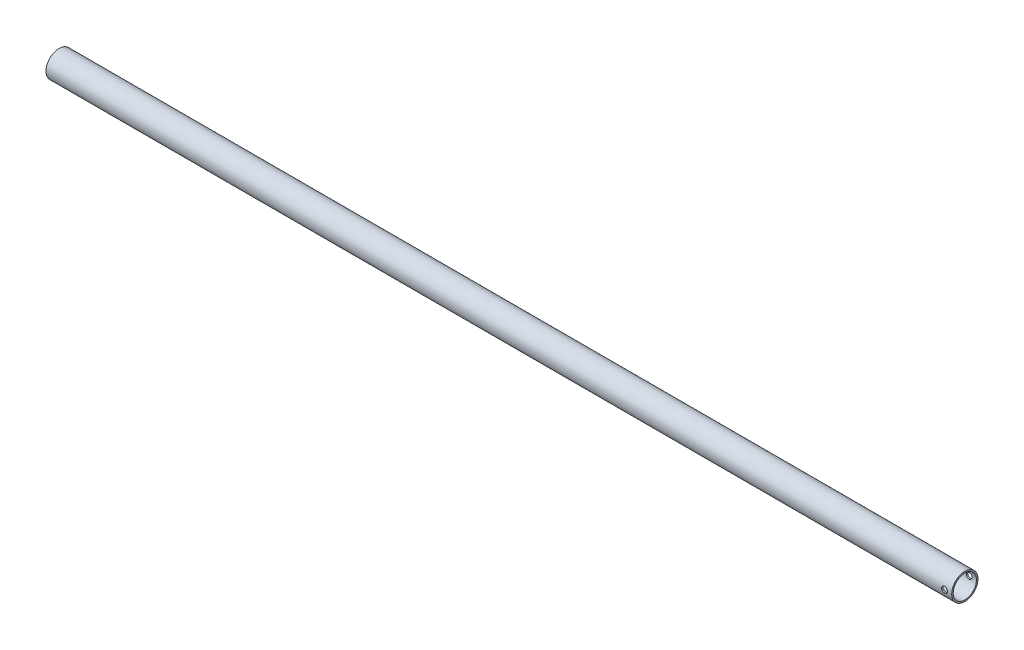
ISO-10303-21;
HEADER;
FILE_DESCRIPTION(('STEP AP214'),'2;1');
FILE_NAME('part.step','',(''),(''),'','','');
FILE_SCHEMA(('AUTOMOTIVE_DESIGN { 1 0 10303 214 1 1 1 1 }'));
ENDSEC;
DATA;
#1=APPLICATION_CONTEXT('core data for automotive mechanical design processes');
#2=APPLICATION_PROTOCOL_DEFINITION('international standard','automotive_design',2000,#1);
#3=PRODUCT_CONTEXT('',#1,'mechanical');
#4=PRODUCT('Part','Part','',(#3));
#5=PRODUCT_RELATED_PRODUCT_CATEGORY('part','',(#4));
#6=PRODUCT_DEFINITION_FORMATION('','',#4);
#7=PRODUCT_DEFINITION_CONTEXT('part definition',#1,'design');
#8=PRODUCT_DEFINITION('design','',#6,#7);
#9=PRODUCT_DEFINITION_SHAPE('','',#8);
#10=(LENGTH_UNIT() NAMED_UNIT(*) SI_UNIT(.MILLI.,.METRE.));
#11=(NAMED_UNIT(*) PLANE_ANGLE_UNIT() SI_UNIT($,.RADIAN.));
#12=(NAMED_UNIT(*) SI_UNIT($,.STERADIAN.) SOLID_ANGLE_UNIT());
#13=UNCERTAINTY_MEASURE_WITH_UNIT(LENGTH_MEASURE(1.E-05),#10,'distance_accuracy_value','');
#14=(GEOMETRIC_REPRESENTATION_CONTEXT(3) GLOBAL_UNCERTAINTY_ASSIGNED_CONTEXT((#13)) GLOBAL_UNIT_ASSIGNED_CONTEXT((#10,
#11,#12)) REPRESENTATION_CONTEXT('',''));
#15=CARTESIAN_POINT('',(0.,0.,0.));
#16=DIRECTION('',(0.,0.,1.));
#17=DIRECTION('',(1.,0.,0.));
#18=AXIS2_PLACEMENT_3D('',#15,#16,#17);
#19=CARTESIAN_POINT('',(0.,14.2875,0.));
#20=DIRECTION('',(1.,0.,0.));
#21=DIRECTION('',(0.,0.,-1.));
#22=AXIS2_PLACEMENT_3D('',#19,#20,#21);
#23=PLANE('',#22);
#24=CARTESIAN_POINT('',(0.,0.,0.));
#25=DIRECTION('',(1.,0.,0.));
#26=DIRECTION('',(0.,0.,-1.));
#27=AXIS2_PLACEMENT_3D('',#24,#25,#26);
#28=CIRCLE('',#27,14.2875);
#29=CARTESIAN_POINT('',(0.,0.,-14.2875));
#30=VERTEX_POINT('',#29);
#31=EDGE_CURVE('E94',#30,#30,#28,.T.);
#32=ORIENTED_EDGE('',*,*,#31,.T.);
#33=EDGE_LOOP('',(#32));
#34=FACE_BOUND('',#33,.T.);
#35=CARTESIAN_POINT('',(0.,0.,0.));
#36=DIRECTION('',(1.,0.,0.));
#37=DIRECTION('',(0.,0.,-1.));
#38=AXIS2_PLACEMENT_3D('',#35,#36,#37);
#39=CIRCLE('',#38,12.6365);
#40=CARTESIAN_POINT('',(0.,0.,-12.6365));
#41=VERTEX_POINT('',#40);
#42=EDGE_CURVE('E10',#41,#41,#39,.T.);
#43=ORIENTED_EDGE('',*,*,#42,.F.);
#44=EDGE_LOOP('',(#43));
#45=FACE_BOUND('',#44,.T.);
#46=ADVANCED_FACE('F30',(#34,#45),#23,.T.);
#47=CARTESIAN_POINT('',(0.,0.,0.));
#48=DIRECTION('',(1.,0.,0.));
#49=DIRECTION('',(0.,0.,-1.));
#50=AXIS2_PLACEMENT_3D('',#47,#48,#49);
#51=CYLINDRICAL_SURFACE('',#50,12.6364999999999);
#52=CARTESIAN_POINT('',(-11.0998,0.,-12.6364999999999));
#53=CARTESIAN_POINT('',(-11.0997951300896,-0.175392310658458,-12.6364970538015));
#54=CARTESIAN_POINT('',(-11.0852176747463,-0.350838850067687,-12.632812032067));
#55=CARTESIAN_POINT('',(-11.0273815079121,-0.696701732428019,-12.6184688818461));
#56=CARTESIAN_POINT('',(-10.9841067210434,-0.867115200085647,-12.607806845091));
#57=CARTESIAN_POINT('',(-10.8703534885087,-1.19786758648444,-12.580690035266));
#58=CARTESIAN_POINT('',(-10.7999078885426,-1.35821839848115,-12.5642422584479));
#59=CARTESIAN_POINT('',(-10.6339287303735,-1.6648266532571,-12.5273046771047));
#60=CARTESIAN_POINT('',(-10.5383942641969,-1.81108358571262,-12.5068147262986));
#61=CARTESIAN_POINT('',(-10.3228516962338,-2.08839269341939,-12.4635401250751));
#62=CARTESIAN_POINT('',(-10.2024201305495,-2.21911017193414,-12.4407197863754));
#63=CARTESIAN_POINT('',(-9.94140850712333,-2.45872056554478,-12.3955929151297));
#64=CARTESIAN_POINT('',(-9.80082615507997,-2.56761099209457,-12.3732864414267));
#65=CARTESIAN_POINT('',(-9.50089944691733,-2.76205463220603,-12.3313527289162));
#66=CARTESIAN_POINT('',(-9.34130494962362,-2.84723266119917,-12.3117707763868));
#67=CARTESIAN_POINT('',(-9.00949056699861,-2.98942057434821,-12.2780240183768));
#68=CARTESIAN_POINT('',(-8.83727272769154,-3.04643501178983,-12.2638583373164));
#69=CARTESIAN_POINT('',(-8.48878254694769,-3.12953400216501,-12.2429149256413));
#70=CARTESIAN_POINT('',(-8.31266262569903,-3.15622071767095,-12.2359935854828));
#71=CARTESIAN_POINT('',(-7.95832001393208,-3.17978249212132,-12.229892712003));
#72=CARTESIAN_POINT('',(-7.78009767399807,-3.17666245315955,-12.2307119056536));
#73=CARTESIAN_POINT('',(-7.43123059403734,-3.14117954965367,-12.2398704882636));
#74=CARTESIAN_POINT('',(-7.26050718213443,-3.10953504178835,-12.2480251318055));
#75=CARTESIAN_POINT('',(-6.92687351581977,-3.01904774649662,-12.2706412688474));
#76=CARTESIAN_POINT('',(-6.76396382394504,-2.96020300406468,-12.285103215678));
#77=CARTESIAN_POINT('',(-6.44865970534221,-2.81637541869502,-12.3188735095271));
#78=CARTESIAN_POINT('',(-6.29638924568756,-2.73113251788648,-12.3382297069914));
#79=CARTESIAN_POINT('',(-6.00805649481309,-2.53711019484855,-12.3795806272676));
#80=CARTESIAN_POINT('',(-5.87199707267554,-2.42832661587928,-12.4015758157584));
#81=CARTESIAN_POINT('',(-5.61583290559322,-2.18659342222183,-12.4465036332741));
#82=CARTESIAN_POINT('',(-5.49630081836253,-2.053037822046,-12.4694450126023));
#83=CARTESIAN_POINT('',(-5.28122089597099,-1.76750165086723,-12.5131090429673));
#84=CARTESIAN_POINT('',(-5.18567380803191,-1.61552050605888,-12.5338316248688));
#85=CARTESIAN_POINT('',(-5.02106277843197,-1.29662523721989,-12.5708280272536));
#86=CARTESIAN_POINT('',(-4.95209263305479,-1.12966074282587,-12.587086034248));
#87=CARTESIAN_POINT('',(-4.84335881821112,-0.786007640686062,-12.6132064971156));
#88=CARTESIAN_POINT('',(-4.80358950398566,-0.609320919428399,-12.6230701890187));
#89=CARTESIAN_POINT('',(-4.75526262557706,-0.256134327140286,-12.6351074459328));
#90=CARTESIAN_POINT('',(-4.74592531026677,-0.0797475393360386,-12.6374730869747));
#91=CARTESIAN_POINT('',(-4.7565877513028,0.27206861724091,-12.6347951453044));
#92=CARTESIAN_POINT('',(-4.77658483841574,0.44749807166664,-12.6297522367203));
#93=CARTESIAN_POINT('',(-4.84470594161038,0.789704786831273,-12.6129469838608));
#94=CARTESIAN_POINT('',(-4.89240387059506,0.956572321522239,-12.6012864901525));
#95=CARTESIAN_POINT('',(-5.01408540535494,1.27992827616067,-12.5725609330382));
#96=CARTESIAN_POINT('',(-5.08807168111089,1.43641563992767,-12.5554953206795));
#97=CARTESIAN_POINT('',(-5.26173612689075,1.73766618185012,-12.5173932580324));
#98=CARTESIAN_POINT('',(-5.36185011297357,1.88216962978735,-12.4962912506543));
#99=CARTESIAN_POINT('',(-5.5843717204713,2.15260205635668,-12.4525593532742));
#100=CARTESIAN_POINT('',(-5.70678323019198,2.27852778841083,-12.4299291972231));
#101=CARTESIAN_POINT('',(-5.97404689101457,2.51144885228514,-12.3849990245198));
#102=CARTESIAN_POINT('',(-6.11938047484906,2.61789696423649,-12.3627211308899));
#103=CARTESIAN_POINT('',(-6.42630730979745,2.80489420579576,-12.3216436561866));
#104=CARTESIAN_POINT('',(-6.58789984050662,2.88544448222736,-12.302843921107));
#105=CARTESIAN_POINT('',(-6.92189416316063,3.01775881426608,-12.2710593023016));
#106=CARTESIAN_POINT('',(-7.0942249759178,3.06969335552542,-12.2580400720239));
#107=CARTESIAN_POINT('',(-7.44554962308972,3.14374831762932,-12.2392591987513));
#108=CARTESIAN_POINT('',(-7.62454197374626,3.16587533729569,-12.233495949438));
#109=CARTESIAN_POINT('',(-7.978537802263,3.17933975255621,-12.230002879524));
#110=CARTESIAN_POINT('',(-8.15350627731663,3.17155211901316,-12.2320447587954));
#111=CARTESIAN_POINT('',(-8.49954940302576,3.12741279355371,-12.2434035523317));
#112=CARTESIAN_POINT('',(-8.67062413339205,3.0910616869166,-12.2527203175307));
#113=CARTESIAN_POINT('',(-9.00306125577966,2.99130738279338,-12.2774512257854));
#114=CARTESIAN_POINT('',(-9.16447633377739,2.92806985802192,-12.2928279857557));
#115=CARTESIAN_POINT('',(-9.47452149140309,2.77646866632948,-12.3279512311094));
#116=CARTESIAN_POINT('',(-9.62314977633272,2.6881014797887,-12.3476983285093));
#117=CARTESIAN_POINT('',(-9.90762667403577,2.48601298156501,-12.3899869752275));
#118=CARTESIAN_POINT('',(-10.0430356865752,2.37168528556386,-12.4125884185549));
#119=CARTESIAN_POINT('',(-10.2930314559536,2.12210071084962,-12.4576833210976));
#120=CARTESIAN_POINT('',(-10.4076132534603,1.9868388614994,-12.4801767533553));
#121=CARTESIAN_POINT('',(-10.6147527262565,1.69623086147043,-12.5230136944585));
#122=CARTESIAN_POINT('',(-10.7068678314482,1.54056179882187,-12.5433101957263));
#123=CARTESIAN_POINT('',(-10.8634745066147,1.21545111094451,-12.5789691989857));
#124=CARTESIAN_POINT('',(-10.9279857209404,1.04601938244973,-12.5943352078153));
#125=CARTESIAN_POINT('',(-11.0180621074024,0.730761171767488,-12.6161509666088));
#126=CARTESIAN_POINT('',(-11.0486472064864,0.586426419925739,-12.6237292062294));
#127=CARTESIAN_POINT('',(-11.0895174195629,0.294740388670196,-12.6339047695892));
#128=CARTESIAN_POINT('',(-11.0998040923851,0.147389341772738,-12.636502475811));
#129=CARTESIAN_POINT('',(-11.0998,0.,-12.6364999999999));
#130=B_SPLINE_CURVE_WITH_KNOTS('',3,(#52,#53,#54,#55,#56,#57,#58,#59,#60,#61,#62,#63,#64,#65,
#66,#67,#68,#69,#70,#71,#72,#73,#74,#75,#76,#77,#78,#79,#80,#81,#82,#83,#84,#85,#86,#87,#88,#89,
#90,#91,#92,#93,#94,#95,#96,#97,#98,#99,#100,#101,#102,#103,#104,#105,#106,#107,#108,#109,#110,
#111,#112,#113,#114,#115,#116,#117,#118,#119,#120,#121,#122,#123,#124,#125,#126,#127,#128,#129),
.UNSPECIFIED.,.T.,.F.,(4,2,2,2,2,2,2,2,2,2,2,2,2,2,2,2,2,2,2,2,2,2,2,2,2,2,2,2,2,2,2,2,2,2,2,2,
2,2,4),(0.,0.525636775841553,1.05156824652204,1.57686592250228,2.10218261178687,
2.63730298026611,3.17248432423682,3.71570598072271,4.25883978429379,4.79099008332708,
5.32305286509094,5.84207948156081,6.36114340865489,6.88549286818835,7.40993499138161,
7.94948787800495,8.4890575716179,9.03051446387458,9.57186666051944,10.0992341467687,
10.626553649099,11.1459691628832,11.6654374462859,12.1941960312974,12.7230469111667,
13.2650195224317,13.8069681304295,14.3456520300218,14.884216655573,15.407150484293,
15.930073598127,16.4498201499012,16.9696395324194,17.5031475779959,18.03678249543,
18.5802064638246,19.1232430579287,19.5649910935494,20.0067052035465),.UNSPECIFIED.);
#131=CARTESIAN_POINT('',(-11.0998,0.,-12.6364999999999));
#132=VERTEX_POINT('',#131);
#133=EDGE_CURVE('E70',#132,#132,#130,.T.);
#134=ORIENTED_EDGE('',*,*,#133,.F.);
#135=EDGE_LOOP('',(#134));
#136=FACE_BOUND('',#135,.T.);
#137=CARTESIAN_POINT('',(-4.7498,0.,12.6364999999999));
#138=CARTESIAN_POINT('',(-4.74980486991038,-0.175392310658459,12.6364970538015));
#139=CARTESIAN_POINT('',(-4.76438232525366,-0.350838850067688,12.632812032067));
#140=CARTESIAN_POINT('',(-4.82221849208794,-0.696701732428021,12.6184688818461));
#141=CARTESIAN_POINT('',(-4.86549327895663,-0.867115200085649,12.607806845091));
#142=CARTESIAN_POINT('',(-4.97924651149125,-1.19786758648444,12.580690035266));
#143=CARTESIAN_POINT('',(-5.04969211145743,-1.35821839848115,12.5642422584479));
#144=CARTESIAN_POINT('',(-5.21567126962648,-1.6648266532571,12.5273046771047));
#145=CARTESIAN_POINT('',(-5.3112057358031,-1.81108358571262,12.5068147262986));
#146=CARTESIAN_POINT('',(-5.52674830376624,-2.08839269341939,12.4635401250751));
#147=CARTESIAN_POINT('',(-5.64717986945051,-2.21911017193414,12.4407197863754));
#148=CARTESIAN_POINT('',(-5.90819149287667,-2.45872056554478,12.3955929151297));
#149=CARTESIAN_POINT('',(-6.04877384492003,-2.56761099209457,12.3732864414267));
#150=CARTESIAN_POINT('',(-6.34870055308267,-2.76205463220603,12.3313527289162));
#151=CARTESIAN_POINT('',(-6.50829505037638,-2.84723266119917,12.3117707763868));
#152=CARTESIAN_POINT('',(-6.84010943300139,-2.98942057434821,12.2780240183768));
#153=CARTESIAN_POINT('',(-7.01232727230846,-3.04643501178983,12.2638583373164));
#154=CARTESIAN_POINT('',(-7.36081745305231,-3.12953400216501,12.2429149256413));
#155=CARTESIAN_POINT('',(-7.53693737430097,-3.15622071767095,12.2359935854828));
#156=CARTESIAN_POINT('',(-7.89127998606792,-3.17978249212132,12.229892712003));
#157=CARTESIAN_POINT('',(-8.06950232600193,-3.17666245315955,12.2307119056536));
#158=CARTESIAN_POINT('',(-8.41836940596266,-3.14117954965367,12.2398704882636));
#159=CARTESIAN_POINT('',(-8.58909281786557,-3.10953504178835,12.2480251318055));
#160=CARTESIAN_POINT('',(-8.92272648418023,-3.01904774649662,12.2706412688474));
#161=CARTESIAN_POINT('',(-9.08563617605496,-2.96020300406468,12.285103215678));
#162=CARTESIAN_POINT('',(-9.40094029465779,-2.81637541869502,12.3188735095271));
#163=CARTESIAN_POINT('',(-9.55321075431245,-2.73113251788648,12.3382297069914));
#164=CARTESIAN_POINT('',(-9.84154350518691,-2.53711019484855,12.3795806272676));
#165=CARTESIAN_POINT('',(-9.97760292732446,-2.42832661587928,12.4015758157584));
#166=CARTESIAN_POINT('',(-10.2337670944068,-2.18659342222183,12.4465036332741));
#167=CARTESIAN_POINT('',(-10.3532991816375,-2.05303782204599,12.4694450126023));
#168=CARTESIAN_POINT('',(-10.568379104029,-1.76750165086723,12.5131090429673));
#169=CARTESIAN_POINT('',(-10.6639261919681,-1.61552050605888,12.5338316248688));
#170=CARTESIAN_POINT('',(-10.828537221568,-1.29662523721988,12.5708280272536));
#171=CARTESIAN_POINT('',(-10.8975073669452,-1.12966074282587,12.587086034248));
#172=CARTESIAN_POINT('',(-11.0062411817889,-0.786007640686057,12.6132064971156));
#173=CARTESIAN_POINT('',(-11.0460104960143,-0.609320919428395,12.6230701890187));
#174=CARTESIAN_POINT('',(-11.0943373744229,-0.256134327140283,12.6351074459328));
#175=CARTESIAN_POINT('',(-11.1036746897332,-0.0797475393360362,12.6374730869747));
#176=CARTESIAN_POINT('',(-11.0930122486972,0.272068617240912,12.6347951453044));
#177=CARTESIAN_POINT('',(-11.0730151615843,0.447498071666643,12.6297522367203));
#178=CARTESIAN_POINT('',(-11.0048940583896,0.789704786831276,12.6129469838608));
#179=CARTESIAN_POINT('',(-10.9571961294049,0.956572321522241,12.6012864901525));
#180=CARTESIAN_POINT('',(-10.8355145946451,1.27992827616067,12.5725609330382));
#181=CARTESIAN_POINT('',(-10.7615283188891,1.43641563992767,12.5554953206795));
#182=CARTESIAN_POINT('',(-10.5878638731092,1.73766618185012,12.5173932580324));
#183=CARTESIAN_POINT('',(-10.4877498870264,1.88216962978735,12.4962912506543));
#184=CARTESIAN_POINT('',(-10.2652282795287,2.15260205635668,12.4525593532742));
#185=CARTESIAN_POINT('',(-10.142816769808,2.27852778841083,12.4299291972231));
#186=CARTESIAN_POINT('',(-9.87555310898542,2.51144885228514,12.3849990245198));
#187=CARTESIAN_POINT('',(-9.73021952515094,2.61789696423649,12.3627211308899));
#188=CARTESIAN_POINT('',(-9.42329269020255,2.80489420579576,12.3216436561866));
#189=CARTESIAN_POINT('',(-9.26170015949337,2.88544448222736,12.302843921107));
#190=CARTESIAN_POINT('',(-8.92770583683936,3.01775881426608,12.2710593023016));
#191=CARTESIAN_POINT('',(-8.7553750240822,3.06969335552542,12.2580400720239));
#192=CARTESIAN_POINT('',(-8.40405037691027,3.14374831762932,12.2392591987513));
#193=CARTESIAN_POINT('',(-8.22505802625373,3.16587533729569,12.233495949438));
#194=CARTESIAN_POINT('',(-7.871062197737,3.17933975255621,12.230002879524));
#195=CARTESIAN_POINT('',(-7.69609372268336,3.17155211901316,12.2320447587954));
#196=CARTESIAN_POINT('',(-7.35005059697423,3.12741279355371,12.2434035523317));
#197=CARTESIAN_POINT('',(-7.17897586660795,3.0910616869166,12.2527203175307));
#198=CARTESIAN_POINT('',(-6.84653874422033,2.99130738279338,12.2774512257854));
#199=CARTESIAN_POINT('',(-6.6851236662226,2.92806985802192,12.2928279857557));
#200=CARTESIAN_POINT('',(-6.3750785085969,2.77646866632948,12.3279512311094));
#201=CARTESIAN_POINT('',(-6.22645022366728,2.6881014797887,12.3476983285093));
#202=CARTESIAN_POINT('',(-5.94197332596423,2.48601298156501,12.3899869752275));
#203=CARTESIAN_POINT('',(-5.8065643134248,2.37168528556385,12.4125884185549));
#204=CARTESIAN_POINT('',(-5.55656854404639,2.12210071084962,12.4576833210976));
#205=CARTESIAN_POINT('',(-5.44198674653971,1.98683886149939,12.4801767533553));
#206=CARTESIAN_POINT('',(-5.23484727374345,1.69623086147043,12.5230136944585));
#207=CARTESIAN_POINT('',(-5.14273216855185,1.54056179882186,12.5433101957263));
#208=CARTESIAN_POINT('',(-4.98612549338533,1.21545111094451,12.5789691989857));
#209=CARTESIAN_POINT('',(-4.92161427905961,1.04601938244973,12.5943352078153));
#210=CARTESIAN_POINT('',(-4.83153789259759,0.730761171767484,12.6161509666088));
#211=CARTESIAN_POINT('',(-4.80095279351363,0.586426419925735,12.6237292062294));
#212=CARTESIAN_POINT('',(-4.76008258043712,0.294740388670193,12.6339047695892));
#213=CARTESIAN_POINT('',(-4.74979590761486,0.147389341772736,12.636502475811));
#214=CARTESIAN_POINT('',(-4.7498,0.,12.6364999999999));
#215=B_SPLINE_CURVE_WITH_KNOTS('',3,(#137,#138,#139,#140,#141,#142,#143,#144,#145,#146,#147,
#148,#149,#150,#151,#152,#153,#154,#155,#156,#157,#158,#159,#160,#161,#162,#163,#164,#165,#166,
#167,#168,#169,#170,#171,#172,#173,#174,#175,#176,#177,#178,#179,#180,#181,#182,#183,#184,#185,
#186,#187,#188,#189,#190,#191,#192,#193,#194,#195,#196,#197,#198,#199,#200,#201,#202,#203,#204,
#205,#206,#207,#208,#209,#210,#211,#212,#213,#214),.UNSPECIFIED.,.T.,.F.,(4,2,2,2,2,2,2,2,2,2,2,
2,2,2,2,2,2,2,2,2,2,2,2,2,2,2,2,2,2,2,2,2,2,2,2,2,2,2,4),(0.,0.525636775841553,1.05156824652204,
1.57686592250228,2.10218261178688,2.63730298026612,3.17248432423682,3.71570598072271,
4.25883978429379,4.79099008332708,5.32305286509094,5.84207948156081,6.36114340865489,
6.88549286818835,7.40993499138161,7.94948787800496,8.4890575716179,9.03051446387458,
9.57186666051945,10.0992341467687,10.626553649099,11.1459691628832,11.6654374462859,
12.1941960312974,12.7230469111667,13.2650195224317,13.8069681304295,14.3456520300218,
14.884216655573,15.407150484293,15.930073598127,16.4498201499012,16.9696395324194,
17.5031475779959,18.03678249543,18.5802064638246,19.1232430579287,19.5649910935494,
20.0067052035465),.UNSPECIFIED.);
#216=CARTESIAN_POINT('',(-4.7498,0.,12.6364999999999));
#217=VERTEX_POINT('',#216);
#218=EDGE_CURVE('E66',#217,#217,#215,.T.);
#219=ORIENTED_EDGE('',*,*,#218,.F.);
#220=EDGE_LOOP('',(#219));
#221=FACE_BOUND('',#220,.T.);
#222=ORIENTED_EDGE('',*,*,#42,.T.);
#223=EDGE_LOOP('',(#222));
#224=FACE_BOUND('',#223,.T.);
#225=CARTESIAN_POINT('',(-984.25,0.,0.));
#226=DIRECTION('',(1.,0.,0.));
#227=DIRECTION('',(0.,0.,-1.));
#228=AXIS2_PLACEMENT_3D('',#225,#226,#227);
#229=CIRCLE('',#228,12.6364999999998);
#230=CARTESIAN_POINT('',(-984.25,0.,-12.6364999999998));
#231=VERTEX_POINT('',#230);
#232=EDGE_CURVE('E41',#231,#231,#229,.T.);
#233=ORIENTED_EDGE('',*,*,#232,.F.);
#234=EDGE_LOOP('',(#233));
#235=FACE_BOUND('',#234,.T.);
#236=ADVANCED_FACE('F74',(#136,#221,#224,#235),#51,.F.);
#237=CARTESIAN_POINT('',(-984.25,12.6364999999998,0.));
#238=DIRECTION('',(-1.,0.,0.));
#239=DIRECTION('',(0.,0.,1.));
#240=AXIS2_PLACEMENT_3D('',#237,#238,#239);
#241=PLANE('',#240);
#242=ORIENTED_EDGE('',*,*,#232,.T.);
#243=EDGE_LOOP('',(#242));
#244=FACE_BOUND('',#243,.T.);
#245=CARTESIAN_POINT('',(-984.25,0.,0.));
#246=DIRECTION('',(1.,0.,0.));
#247=DIRECTION('',(0.,0.,-1.));
#248=AXIS2_PLACEMENT_3D('',#245,#246,#247);
#249=CIRCLE('',#248,14.2874999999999);
#250=CARTESIAN_POINT('',(-984.25,0.,-14.2874999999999));
#251=VERTEX_POINT('',#250);
#252=EDGE_CURVE('E46',#251,#251,#249,.T.);
#253=ORIENTED_EDGE('',*,*,#252,.F.);
#254=EDGE_LOOP('',(#253));
#255=FACE_BOUND('',#254,.T.);
#256=ADVANCED_FACE('F77',(#244,#255),#241,.T.);
#257=CARTESIAN_POINT('',(0.,0.,0.));
#258=DIRECTION('',(1.,0.,0.));
#259=DIRECTION('',(0.,0.,-1.));
#260=AXIS2_PLACEMENT_3D('',#257,#258,#259);
#261=CYLINDRICAL_SURFACE('',#260,14.2874999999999);
#262=CARTESIAN_POINT('',(-11.0998,0.,-14.2874999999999));
#263=CARTESIAN_POINT('',(-11.0997940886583,0.176022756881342,-14.2874967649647));
#264=CARTESIAN_POINT('',(-11.0851124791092,0.352116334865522,-14.2842140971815));
#265=CARTESIAN_POINT('',(-11.0268377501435,0.699296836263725,-14.271436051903));
#266=CARTESIAN_POINT('',(-10.9832244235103,0.870380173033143,-14.2619363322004));
#267=CARTESIAN_POINT('',(-10.8685235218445,1.20247295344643,-14.2377812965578));
#268=CARTESIAN_POINT('',(-10.7974651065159,1.3634928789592,-14.2231314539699));
#269=CARTESIAN_POINT('',(-10.6299847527,1.6713202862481,-14.1902550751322));
#270=CARTESIAN_POINT('',(-10.5335633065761,1.81812804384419,-14.1720286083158));
#271=CARTESIAN_POINT('',(-10.3164073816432,2.09579577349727,-14.1336568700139));
#272=CARTESIAN_POINT('',(-10.1953337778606,2.22638717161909,-14.1134871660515));
#273=CARTESIAN_POINT('',(-9.93303820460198,2.46558579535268,-14.0736732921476));
#274=CARTESIAN_POINT('',(-9.79181439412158,2.5741910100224,-14.0540291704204));
#275=CARTESIAN_POINT('',(-9.49123094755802,2.76752753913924,-14.0172492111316));
#276=CARTESIAN_POINT('',(-9.33168225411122,2.85197140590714,-14.0001446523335));
#277=CARTESIAN_POINT('',(-9.00021574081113,2.99274387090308,-13.9707317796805));
#278=CARTESIAN_POINT('',(-8.82829945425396,3.04907594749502,-13.9584228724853));
#279=CARTESIAN_POINT('',(-8.47989560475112,3.13113512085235,-13.9402440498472));
#280=CARTESIAN_POINT('',(-8.30352556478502,3.15733853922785,-13.9342740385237));
#281=CARTESIAN_POINT('',(-7.94879947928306,3.17987792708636,-13.9291484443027));
#282=CARTESIAN_POINT('',(-7.77044368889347,3.17621769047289,-13.9299919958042));
#283=CARTESIAN_POINT('',(-7.42036135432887,3.13951663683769,-13.938307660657));
#284=CARTESIAN_POINT('',(-7.24857322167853,3.10703062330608,-13.9456545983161));
#285=CARTESIAN_POINT('',(-6.91294790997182,3.01447978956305,-13.9659511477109));
#286=CARTESIAN_POINT('',(-6.7491111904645,2.95441337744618,-13.9789010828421));
#287=CARTESIAN_POINT('',(-6.43248739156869,2.80790130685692,-14.0090669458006));
#288=CARTESIAN_POINT('',(-6.27980181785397,2.72124359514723,-14.0263169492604));
#289=CARTESIAN_POINT('',(-5.99093469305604,2.5241578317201,-14.063118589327));
#290=CARTESIAN_POINT('',(-5.85475546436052,2.4137264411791,-14.0826705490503));
#291=CARTESIAN_POINT('',(-5.5995739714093,2.16929785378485,-14.1224091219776));
#292=CARTESIAN_POINT('',(-5.48102347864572,2.03482925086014,-14.1426001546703));
#293=CARTESIAN_POINT('',(-5.26808108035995,1.74768925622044,-14.1809444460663));
#294=CARTESIAN_POINT('',(-5.17368964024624,1.59501751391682,-14.1990976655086));
#295=CARTESIAN_POINT('',(-5.01162752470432,1.27524381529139,-14.2313828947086));
#296=CARTESIAN_POINT('',(-4.94401753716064,1.10811011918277,-14.2455057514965));
#297=CARTESIAN_POINT('',(-4.83796814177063,0.76447004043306,-14.2680711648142));
#298=CARTESIAN_POINT('',(-4.79952435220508,0.587965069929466,-14.2765145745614));
#299=CARTESIAN_POINT('',(-4.75355917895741,0.23446657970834,-14.2866477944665));
#300=CARTESIAN_POINT('',(-4.74542088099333,0.0575570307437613,-14.2884723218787));
#301=CARTESIAN_POINT('',(-4.75862349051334,-0.295093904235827,-14.2855403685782));
#302=CARTESIAN_POINT('',(-4.77996233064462,-0.470835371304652,-14.2807843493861));
#303=CARTESIAN_POINT('',(-4.85100219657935,-0.814106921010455,-14.2653108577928));
#304=CARTESIAN_POINT('',(-4.90037827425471,-0.981707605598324,-14.2546617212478));
#305=CARTESIAN_POINT('',(-5.02572922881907,-1.30624707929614,-14.2285945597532));
#306=CARTESIAN_POINT('',(-5.10170642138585,-1.46318493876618,-14.2131761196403));
#307=CARTESIAN_POINT('',(-5.27937869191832,-1.7644847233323,-14.1789491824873));
#308=CARTESIAN_POINT('',(-5.38143440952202,-1.90862859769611,-14.1600943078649));
#309=CARTESIAN_POINT('',(-5.6078933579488,-2.17796580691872,-14.1211781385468));
#310=CARTESIAN_POINT('',(-5.7322995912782,-2.30315659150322,-14.1011166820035));
#311=CARTESIAN_POINT('',(-6.00276300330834,-2.53348407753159,-14.0615809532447));
#312=CARTESIAN_POINT('',(-6.14918774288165,-2.63819293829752,-14.0421251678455));
#313=CARTESIAN_POINT('',(-6.45790560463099,-2.82153696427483,-14.0064394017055));
#314=CARTESIAN_POINT('',(-6.62019803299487,-2.90017326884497,-13.9902092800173));
#315=CARTESIAN_POINT('',(-6.95516815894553,-3.02860078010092,-13.9629705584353));
#316=CARTESIAN_POINT('',(-7.12778045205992,-3.07855598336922,-13.9519323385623));
#317=CARTESIAN_POINT('',(-7.47922714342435,-3.14867968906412,-13.9362759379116));
#318=CARTESIAN_POINT('',(-7.6580605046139,-3.16885313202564,-13.9316566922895));
#319=CARTESIAN_POINT('',(-8.01255521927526,-3.1786251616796,-13.9294298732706));
#320=CARTESIAN_POINT('',(-8.1881972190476,-3.16890262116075,-13.9316666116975));
#321=CARTESIAN_POINT('',(-8.53527266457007,-3.12068014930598,-13.9425468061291));
#322=CARTESIAN_POINT('',(-8.70670616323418,-3.08218057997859,-13.9511901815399));
#323=CARTESIAN_POINT('',(-9.03993797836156,-2.97782964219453,-13.973832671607));
#324=CARTESIAN_POINT('',(-9.20176962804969,-2.91208010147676,-13.9878118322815));
#325=CARTESIAN_POINT('',(-9.51220473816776,-2.75518197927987,-14.0195580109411));
#326=CARTESIAN_POINT('',(-9.66080676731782,-2.66403065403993,-14.0373254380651));
#327=CARTESIAN_POINT('',(-9.94390411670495,-2.45667782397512,-14.0751090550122));
#328=CARTESIAN_POINT('',(-10.0780408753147,-2.33999381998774,-14.0951643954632));
#329=CARTESIAN_POINT('',(-10.325052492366,-2.08586182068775,-14.1350043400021));
#330=CARTESIAN_POINT('',(-10.4379224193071,-1.94840902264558,-14.154788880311));
#331=CARTESIAN_POINT('',(-10.6406568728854,-1.65440672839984,-14.1921747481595));
#332=CARTESIAN_POINT('',(-10.7301906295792,-1.49762469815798,-14.2097430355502));
#333=CARTESIAN_POINT('',(-10.8814922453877,-1.17087694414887,-14.2403839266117));
#334=CARTESIAN_POINT('',(-10.9432830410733,-1.00092224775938,-14.2534602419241));
#335=CARTESIAN_POINT('',(-11.0265231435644,-0.692369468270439,-14.2713521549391));
#336=CARTESIAN_POINT('',(-11.0539488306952,-0.555421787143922,-14.2773696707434));
#337=CARTESIAN_POINT('',(-11.090589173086,-0.278997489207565,-14.2854447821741));
#338=CARTESIAN_POINT('',(-11.0998046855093,-0.139520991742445,-14.2875025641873));
#339=CARTESIAN_POINT('',(-11.0998,0.,-14.2874999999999));
#340=B_SPLINE_CURVE_WITH_KNOTS('',3,(#262,#263,#264,#265,#266,#267,#268,#269,#270,#271,#272,
#273,#274,#275,#276,#277,#278,#279,#280,#281,#282,#283,#284,#285,#286,#287,#288,#289,#290,#291,
#292,#293,#294,#295,#296,#297,#298,#299,#300,#301,#302,#303,#304,#305,#306,#307,#308,#309,#310,
#311,#312,#313,#314,#315,#316,#317,#318,#319,#320,#321,#322,#323,#324,#325,#326,#327,#328,#329,
#330,#331,#332,#333,#334,#335,#336,#337,#338,#339),.UNSPECIFIED.,.T.,.F.,(4,2,2,2,2,2,2,2,2,2,2,
2,2,2,2,2,2,2,2,2,2,2,2,2,2,2,2,2,2,2,2,2,2,2,2,2,2,2,4),(0.,0.527557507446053,1.05548387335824,
1.58285086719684,2.1102076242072,2.645379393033,3.18060008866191,3.72194607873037,
4.26322506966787,4.7958236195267,5.32835450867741,5.85085298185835,6.3733816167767,
6.90019050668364,7.42707343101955,7.96572860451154,8.50439415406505,9.04427345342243,
9.58407162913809,10.1128193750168,10.6415300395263,11.1642345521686,11.6869845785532,
12.2173968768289,12.7478804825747,13.2884778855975,13.8290516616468,14.3665028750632,
14.9038649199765,15.4291154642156,15.9543594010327,16.4776580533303,17.0010132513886,
17.5352761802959,18.069662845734,18.6112560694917,19.1524007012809,19.5705785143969,
19.988736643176),.UNSPECIFIED.);
#341=CARTESIAN_POINT('',(-11.0998,0.,-14.2874999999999));
#342=VERTEX_POINT('',#341);
#343=EDGE_CURVE('E33',#342,#342,#340,.T.);
#344=ORIENTED_EDGE('',*,*,#343,.F.);
#345=EDGE_LOOP('',(#344));
#346=FACE_BOUND('',#345,.T.);
#347=CARTESIAN_POINT('',(-4.7498,0.,14.2874999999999));
#348=CARTESIAN_POINT('',(-4.74980591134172,0.176022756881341,14.2874967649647));
#349=CARTESIAN_POINT('',(-4.76448752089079,0.352116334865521,14.2842140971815));
#350=CARTESIAN_POINT('',(-4.82276224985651,0.699296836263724,14.271436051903));
#351=CARTESIAN_POINT('',(-4.86637557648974,0.870380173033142,14.2619363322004));
#352=CARTESIAN_POINT('',(-4.9810764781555,1.20247295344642,14.2377812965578));
#353=CARTESIAN_POINT('',(-5.05213489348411,1.3634928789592,14.2231314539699));
#354=CARTESIAN_POINT('',(-5.21961524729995,1.6713202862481,14.1902550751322));
#355=CARTESIAN_POINT('',(-5.31603669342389,1.81812804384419,14.1720286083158));
#356=CARTESIAN_POINT('',(-5.53319261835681,2.09579577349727,14.1336568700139));
#357=CARTESIAN_POINT('',(-5.65426622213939,2.22638717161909,14.1134871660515));
#358=CARTESIAN_POINT('',(-5.91656179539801,2.46558579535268,14.0736732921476));
#359=CARTESIAN_POINT('',(-6.05778560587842,2.5741910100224,14.0540291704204));
#360=CARTESIAN_POINT('',(-6.35836905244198,2.76752753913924,14.0172492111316));
#361=CARTESIAN_POINT('',(-6.51791774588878,2.85197140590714,14.0001446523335));
#362=CARTESIAN_POINT('',(-6.84938425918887,2.99274387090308,13.9707317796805));
#363=CARTESIAN_POINT('',(-7.02130054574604,3.04907594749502,13.9584228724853));
#364=CARTESIAN_POINT('',(-7.36970439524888,3.13113512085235,13.9402440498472));
#365=CARTESIAN_POINT('',(-7.54607443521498,3.15733853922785,13.9342740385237));
#366=CARTESIAN_POINT('',(-7.90080052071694,3.17987792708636,13.9291484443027));
#367=CARTESIAN_POINT('',(-8.07915631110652,3.17621769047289,13.9299919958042));
#368=CARTESIAN_POINT('',(-8.42923864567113,3.13951663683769,13.938307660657));
#369=CARTESIAN_POINT('',(-8.60102677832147,3.10703062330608,13.9456545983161));
#370=CARTESIAN_POINT('',(-8.93665209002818,3.01447978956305,13.9659511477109));
#371=CARTESIAN_POINT('',(-9.1004888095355,2.95441337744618,13.9789010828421));
#372=CARTESIAN_POINT('',(-9.41711260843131,2.80790130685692,14.0090669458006));
#373=CARTESIAN_POINT('',(-9.56979818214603,2.72124359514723,14.0263169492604));
#374=CARTESIAN_POINT('',(-9.85866530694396,2.5241578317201,14.063118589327));
#375=CARTESIAN_POINT('',(-9.99484453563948,2.4137264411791,14.0826705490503));
#376=CARTESIAN_POINT('',(-10.2500260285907,2.16929785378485,14.1224091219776));
#377=CARTESIAN_POINT('',(-10.3685765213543,2.03482925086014,14.1426001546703));
#378=CARTESIAN_POINT('',(-10.58151891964,1.74768925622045,14.1809444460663));
#379=CARTESIAN_POINT('',(-10.6759103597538,1.59501751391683,14.1990976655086));
#380=CARTESIAN_POINT('',(-10.8379724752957,1.27524381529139,14.2313828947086));
#381=CARTESIAN_POINT('',(-10.9055824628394,1.10811011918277,14.2455057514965));
#382=CARTESIAN_POINT('',(-11.0116318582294,0.764470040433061,14.2680711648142));
#383=CARTESIAN_POINT('',(-11.0500756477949,0.587965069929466,14.2765145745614));
#384=CARTESIAN_POINT('',(-11.0960408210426,0.23446657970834,14.2866477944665));
#385=CARTESIAN_POINT('',(-11.1041791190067,0.0575570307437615,14.2884723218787));
#386=CARTESIAN_POINT('',(-11.0909765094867,-0.295093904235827,14.2855403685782));
#387=CARTESIAN_POINT('',(-11.0696376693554,-0.470835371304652,14.2807843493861));
#388=CARTESIAN_POINT('',(-10.9985978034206,-0.814106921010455,14.2653108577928));
#389=CARTESIAN_POINT('',(-10.9492217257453,-0.981707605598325,14.2546617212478));
#390=CARTESIAN_POINT('',(-10.8238707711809,-1.30624707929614,14.2285945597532));
#391=CARTESIAN_POINT('',(-10.7478935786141,-1.46318493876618,14.2131761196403));
#392=CARTESIAN_POINT('',(-10.5702213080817,-1.7644847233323,14.1789491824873));
#393=CARTESIAN_POINT('',(-10.468165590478,-1.90862859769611,14.1600943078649));
#394=CARTESIAN_POINT('',(-10.2417066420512,-2.17796580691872,14.1211781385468));
#395=CARTESIAN_POINT('',(-10.1173004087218,-2.30315659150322,14.1011166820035));
#396=CARTESIAN_POINT('',(-9.84683699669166,-2.53348407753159,14.0615809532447));
#397=CARTESIAN_POINT('',(-9.70041225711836,-2.63819293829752,14.0421251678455));
#398=CARTESIAN_POINT('',(-9.39169439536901,-2.82153696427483,14.0064394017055));
#399=CARTESIAN_POINT('',(-9.22940196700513,-2.90017326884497,13.9902092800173));
#400=CARTESIAN_POINT('',(-8.89443184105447,-3.02860078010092,13.9629705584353));
#401=CARTESIAN_POINT('',(-8.72181954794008,-3.07855598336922,13.9519323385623));
#402=CARTESIAN_POINT('',(-8.37037285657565,-3.14867968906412,13.9362759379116));
#403=CARTESIAN_POINT('',(-8.1915394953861,-3.16885313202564,13.9316566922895));
#404=CARTESIAN_POINT('',(-7.83704478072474,-3.1786251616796,13.9294298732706));
#405=CARTESIAN_POINT('',(-7.6614027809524,-3.16890262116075,13.9316666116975));
#406=CARTESIAN_POINT('',(-7.31432733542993,-3.12068014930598,13.9425468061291));
#407=CARTESIAN_POINT('',(-7.14289383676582,-3.08218057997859,13.9511901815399));
#408=CARTESIAN_POINT('',(-6.80966202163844,-2.97782964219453,13.973832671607));
#409=CARTESIAN_POINT('',(-6.64783037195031,-2.91208010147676,13.9878118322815));
#410=CARTESIAN_POINT('',(-6.33739526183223,-2.75518197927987,14.0195580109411));
#411=CARTESIAN_POINT('',(-6.18879323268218,-2.66403065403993,14.0373254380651));
#412=CARTESIAN_POINT('',(-5.90569588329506,-2.45667782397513,14.0751090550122));
#413=CARTESIAN_POINT('',(-5.77155912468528,-2.33999381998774,14.0951643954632));
#414=CARTESIAN_POINT('',(-5.52454750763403,-2.08586182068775,14.1350043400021));
#415=CARTESIAN_POINT('',(-5.4116775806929,-1.94840902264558,14.154788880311));
#416=CARTESIAN_POINT('',(-5.20894312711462,-1.65440672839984,14.1921747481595));
#417=CARTESIAN_POINT('',(-5.11940937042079,-1.49762469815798,14.2097430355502));
#418=CARTESIAN_POINT('',(-4.96810775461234,-1.17087694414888,14.2403839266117));
#419=CARTESIAN_POINT('',(-4.90631695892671,-1.00092224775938,14.2534602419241));
#420=CARTESIAN_POINT('',(-4.8230768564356,-0.69236946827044,14.2713521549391));
#421=CARTESIAN_POINT('',(-4.79565116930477,-0.555421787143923,14.2773696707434));
#422=CARTESIAN_POINT('',(-4.75901082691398,-0.278997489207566,14.2854447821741));
#423=CARTESIAN_POINT('',(-4.74979531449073,-0.139520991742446,14.2875025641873));
#424=CARTESIAN_POINT('',(-4.7498,0.,14.2874999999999));
#425=B_SPLINE_CURVE_WITH_KNOTS('',3,(#347,#348,#349,#350,#351,#352,#353,#354,#355,#356,#357,
#358,#359,#360,#361,#362,#363,#364,#365,#366,#367,#368,#369,#370,#371,#372,#373,#374,#375,#376,
#377,#378,#379,#380,#381,#382,#383,#384,#385,#386,#387,#388,#389,#390,#391,#392,#393,#394,#395,
#396,#397,#398,#399,#400,#401,#402,#403,#404,#405,#406,#407,#408,#409,#410,#411,#412,#413,#414,
#415,#416,#417,#418,#419,#420,#421,#422,#423,#424),.UNSPECIFIED.,.T.,.F.,(4,2,2,2,2,2,2,2,2,2,2,
2,2,2,2,2,2,2,2,2,2,2,2,2,2,2,2,2,2,2,2,2,2,2,2,2,2,2,4),(0.,0.527557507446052,1.05548387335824,
1.58285086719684,2.1102076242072,2.645379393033,3.18060008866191,3.72194607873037,
4.26322506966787,4.7958236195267,5.32835450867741,5.85085298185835,6.3733816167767,
6.90019050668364,7.42707343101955,7.96572860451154,8.50439415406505,9.04427345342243,
9.58407162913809,10.1128193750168,10.6415300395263,11.1642345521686,11.6869845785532,
12.2173968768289,12.7478804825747,13.2884778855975,13.8290516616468,14.3665028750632,
14.9038649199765,15.4291154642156,15.9543594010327,16.4776580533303,17.0010132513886,
17.5352761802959,18.069662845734,18.6112560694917,19.1524007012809,19.5705785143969,
19.988736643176),.UNSPECIFIED.);
#426=CARTESIAN_POINT('',(-4.7498,0.,14.2874999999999));
#427=VERTEX_POINT('',#426);
#428=EDGE_CURVE('E49',#427,#427,#425,.T.);
#429=ORIENTED_EDGE('',*,*,#428,.F.);
#430=EDGE_LOOP('',(#429));
#431=FACE_BOUND('',#430,.T.);
#432=ORIENTED_EDGE('',*,*,#252,.T.);
#433=EDGE_LOOP('',(#432));
#434=FACE_BOUND('',#433,.T.);
#435=ORIENTED_EDGE('',*,*,#31,.F.);
#436=EDGE_LOOP('',(#435));
#437=FACE_BOUND('',#436,.T.);
#438=ADVANCED_FACE('F53',(#346,#431,#434,#437),#261,.T.);
#439=CARTESIAN_POINT('',(-7.9248,0.,-25.4));
#440=DIRECTION('',(0.,0.,1.));
#441=DIRECTION('',(1.,0.,0.));
#442=AXIS2_PLACEMENT_3D('',#439,#440,#441);
#443=CYLINDRICAL_SURFACE('',#442,3.175);
#444=ORIENTED_EDGE('',*,*,#218,.T.);
#445=EDGE_LOOP('',(#444));
#446=FACE_BOUND('',#445,.T.);
#447=ORIENTED_EDGE('',*,*,#428,.T.);
#448=EDGE_LOOP('',(#447));
#449=FACE_BOUND('',#448,.T.);
#450=ADVANCED_FACE('F56',(#446,#449),#443,.F.);
#451=ORIENTED_EDGE('',*,*,#133,.T.);
#452=EDGE_LOOP('',(#451));
#453=FACE_BOUND('',#452,.T.);
#454=ORIENTED_EDGE('',*,*,#343,.T.);
#455=EDGE_LOOP('',(#454));
#456=FACE_BOUND('',#455,.T.);
#457=ADVANCED_FACE('F59',(#453,#456),#443,.F.);
#458=CLOSED_SHELL('',(#46,#236,#256,#438,#450,#457));
#459=MANIFOLD_SOLID_BREP('B2',#458);
#460=ADVANCED_BREP_SHAPE_REPRESENTATION('',(#18,#459),#14);
#461=SHAPE_DEFINITION_REPRESENTATION(#9,#460);
ENDSEC;
END-ISO-10303-21;
